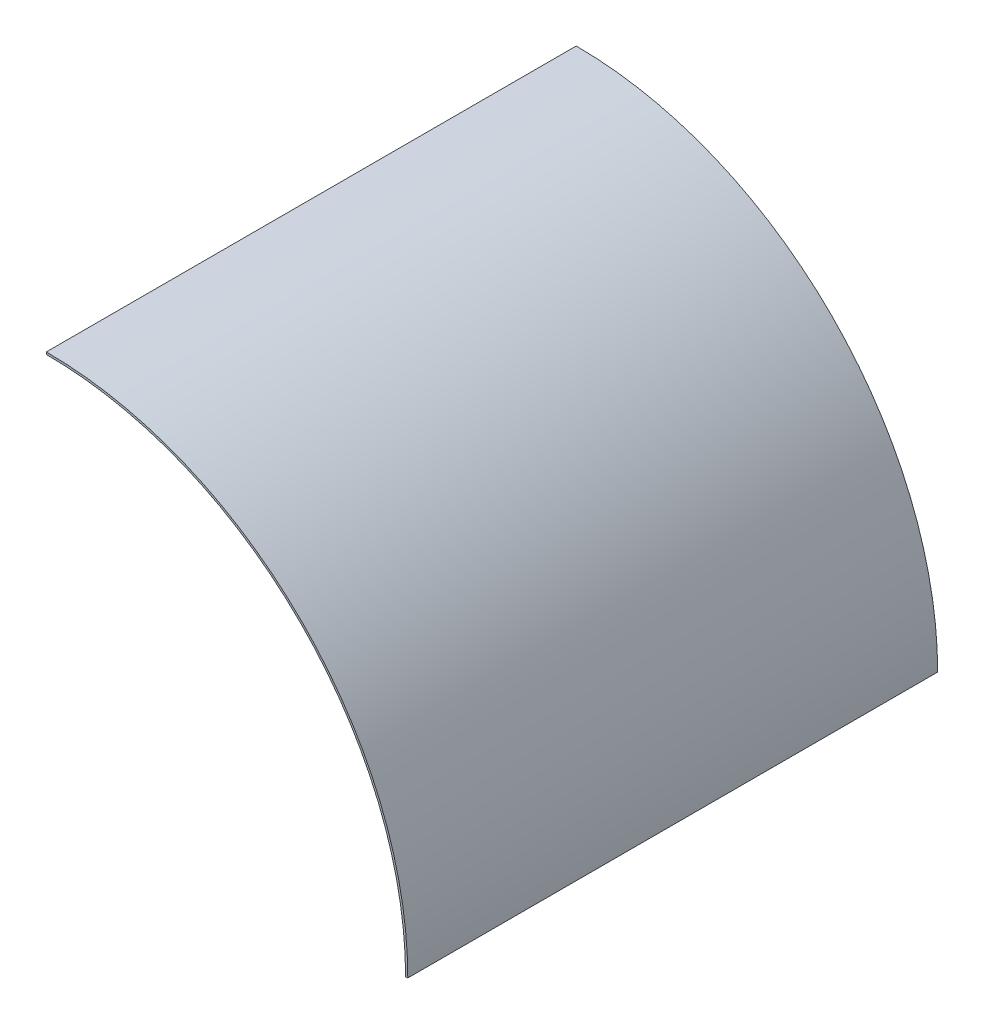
from build123d import *

# Parameters (mm, degrees)
BOSS_EXTRUDE1_DEPTH = 3000


with BuildPart() as part:
    # Sketch1 → Boss-Extrude1 (new body)
    with BuildSketch(Plane.XY):
        with BuildLine():
            Line((0, 2046.5), (0, 2034))
            ThreePointArc((0, 2034), (1438.255192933, 1438.255192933), (2034, 0))
            Line((2034, 0), (2046.5, 0))
            ThreePointArc((2046.5, 0), (1447.094027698, 1447.094027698), (0, 2046.5))
        make_face()
    extrude(amount=-BOSS_EXTRUDE1_DEPTH)


solid = part.part
